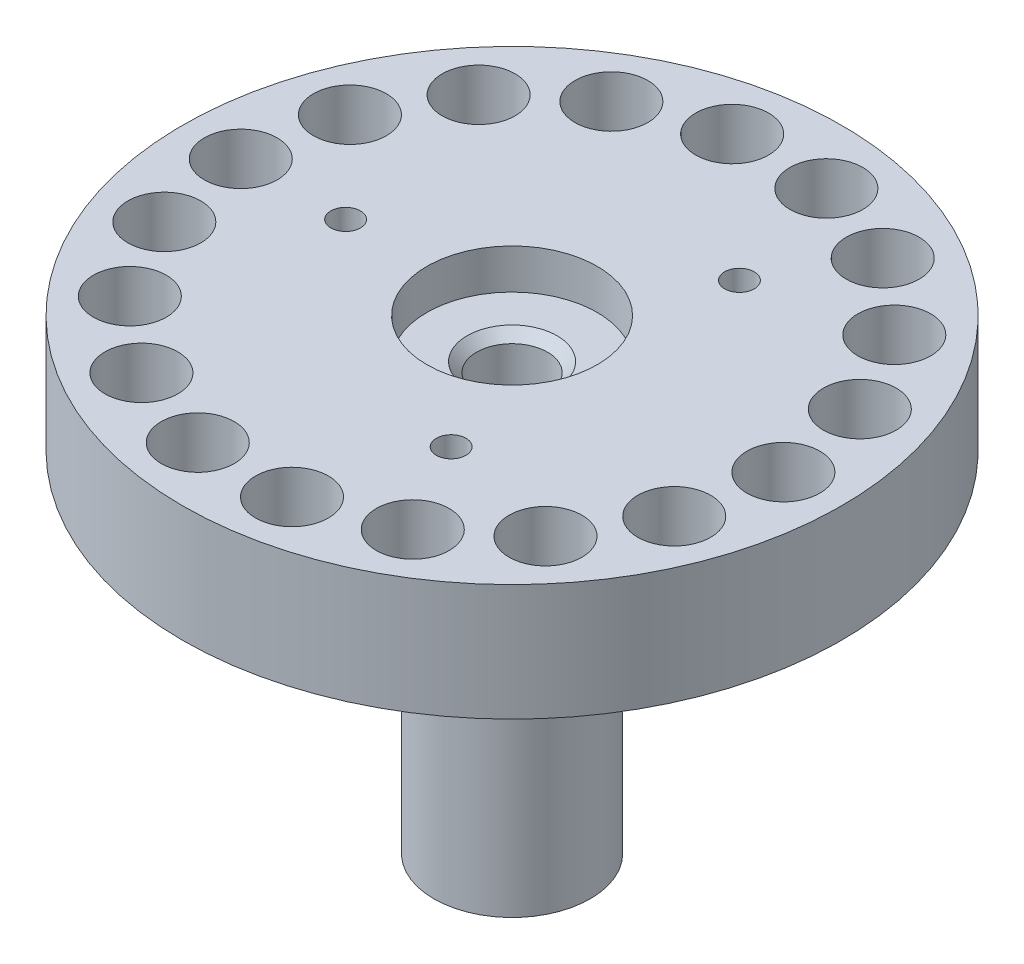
from build123d import *

# Parameters (mm, degrees)
F_1_4_28_TAPPED_HOLE1_D                        = 5.4102
F_1_4_28_TAPPED_HOLE1_DEPTH                    = 8.89
SKETCH5_R                                      = 1.0287
CUT_EXTRUDE1_DEPTH                             = 43.692405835
F_4_40_TAPPED_HOLE1_D                          = 2.2606
F_4_40_TAPPED_HOLE1_DEPTH                      = 5.334
F_4_40_TAPPED_HOLE1_TIP                        = 0.679152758
CBORE_FOR_5_SOCKET_HEAD_CAP_SCREW1_D           = 3.4544
CBORE_FOR_5_SOCKET_HEAD_CAP_SCREW1_CBORE_D     = 5.5626
CBORE_FOR_5_SOCKET_HEAD_CAP_SCREW1_CBORE_DEPTH = 5.842
CIRPATTERN1_COUNT                              = 18


with BuildPart() as part:
    # Sketch1 → Revolve1 (revolve)
    with BuildSketch(Plane(origin=(0, 0, 0), x_dir=(0, 0, -1), z_dir=(1, 0, 0)), mode=Mode.PRIVATE) as revolve1_sk:
        Polygon((0, -3.048), (6.5024, -3.048), (6.5024, 0), (25.146, 0), (25.146, -8.89), (10.7188, -8.89), (10.7188, -7.62), (8.5852, -7.62), (8.5852, -8.89), (5.969, -8.89), (5.969, -35.56), (0, -35.56), align=None)
    revolve(revolve1_sk.sketch.rotate(Axis((0, 0, 0), (0, -1, 0)), 180), axis=Axis((0, 0, 0), (0, -1, 0)))

    # 1_4-28 Tapped Hole1
    with Locations(Plane.XZ.offset(35.56)):
        with Locations((0, 0)):
            f_1_4_28_tapped_hole1 = Hole(F_1_4_28_TAPPED_HOLE1_D / 2, depth=F_1_4_28_TAPPED_HOLE1_DEPTH)

    # Sketch4 → Cut-Revolve1 (revolve, cut)
    with BuildSketch(Plane.XY, mode=Mode.PRIVATE) as cut_revolve1_sk:
        Polygon((-2.118386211, -34.249386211), (-3.429, -35.56), (-2.118386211, -35.56), align=None)
    cut_revolve1 = revolve(cut_revolve1_sk.sketch.rotate(Axis((0, 0, 0), (0, -1, 0)), 90), axis=Axis((0, 0, 0), (0, -1, 0)), mode=Mode.SUBTRACT)

    # Mirror1: 1_4-28 Tapped Hole1, Cut-Revolve1 across plane
    add(f_1_4_28_tapped_hole1.mirror(Plane(origin=(0, -19.304, 0), x_dir=(0, 0, 1), z_dir=(0, -1, 0))), mode=Mode.SUBTRACT)
    add(cut_revolve1.mirror(Plane(origin=(0, -19.304, 0), x_dir=(0, 0, 1), z_dir=(0, -1, 0))), mode=Mode.SUBTRACT)

    # Sketch5 → Cut-Extrude1 (cut, through all)
    with BuildSketch(Plane(origin=(0, -11.938, 0), x_dir=(-1, 0, 0), z_dir=(0, 1, 0))):
        with Locations(Location((0, 0, 0), (0, 0, 90))):
            Circle(SKETCH5_R)
    extrude(amount=-CUT_EXTRUDE1_DEPTH, mode=Mode.SUBTRACT)

    # 4-40 Tapped Hole1
    with Locations(Plane(origin=(0, 0, 0), x_dir=(-1, 0, 0), z_dir=(0, 1, 0))):
        with Locations((12.7, 0), (-6.35, -10.998522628), (-6.35, 10.998522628)):
            Hole(F_4_40_TAPPED_HOLE1_D / 2, depth=F_4_40_TAPPED_HOLE1_DEPTH)
            with Locations((0, 0, -(F_4_40_TAPPED_HOLE1_DEPTH + F_4_40_TAPPED_HOLE1_TIP / 2))):  # 118° drill point
                Cone(0, F_4_40_TAPPED_HOLE1_D / 2, F_4_40_TAPPED_HOLE1_TIP, mode=Mode.SUBTRACT)

    # CBORE for _5 Socket Head Cap Screw1 (through all)
    with Locations(Plane(origin=(0, 0, 0), x_dir=(-1, 0, 0), z_dir=(0, 1, 0))):
        with Locations((-3.594690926, 20.386505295)):
            cbore_for_5_socket_head_cap_screw1 = CounterBoreHole(CBORE_FOR_5_SOCKET_HEAD_CAP_SCREW1_D / 2, CBORE_FOR_5_SOCKET_HEAD_CAP_SCREW1_CBORE_D / 2, CBORE_FOR_5_SOCKET_HEAD_CAP_SCREW1_CBORE_DEPTH)

    # CirPattern1: CBORE for _5 Socket Head Cap Screw1 ×18 about axis
    cirpattern1_axis = Axis((0, 0, 0), (0, 1, 0))
    for i in range(1, CIRPATTERN1_COUNT):
        add(cbore_for_5_socket_head_cap_screw1.rotate(cirpattern1_axis, i * 360 / CIRPATTERN1_COUNT), mode=Mode.SUBTRACT)


solid = part.part
